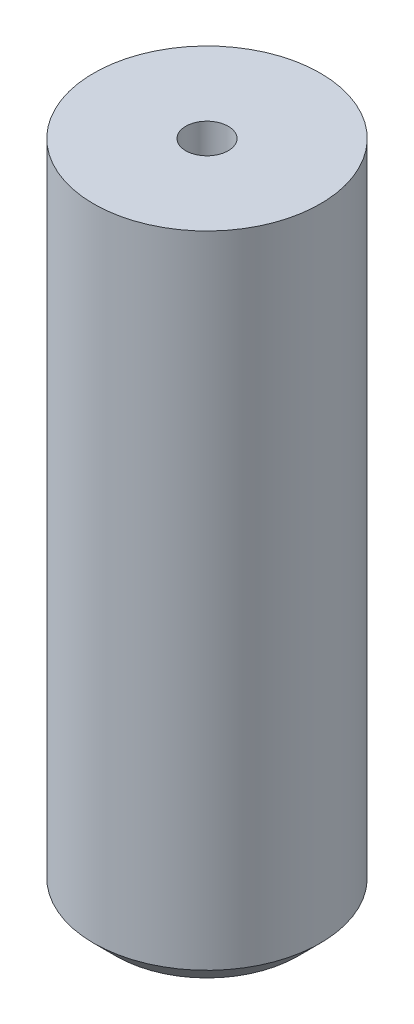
from build123d import *

# Parameters (mm, degrees)
F_0_75_0_75_DIAMETER_HOLE1_D = 0.75


with BuildPart() as part:
    # Sketch1 → Revolve1 (revolve)
    with BuildSketch(Plane.XY, mode=Mode.PRIVATE) as revolve1_sk:
        Polygon((0, 0), (2, 0), (2, -11.3), (1.6, -11.7), (1, -11.7), (1, -8.7), (0, -8.7), align=None)
    revolve(revolve1_sk.sketch.rotate(Axis((0, 0, 0), (0, 1, 0)), 90), axis=Axis((0, 0, 0), (0, 1, 0)))

    # 0.75 _0.75_ Diameter Hole1 (through all)
    with Locations(Plane(origin=(0, 0, 0), x_dir=(1, 0, 0), z_dir=(0, 1, 0))):
        with Locations((0, 0)):
            Hole(F_0_75_0_75_DIAMETER_HOLE1_D / 2)


solid = part.part
